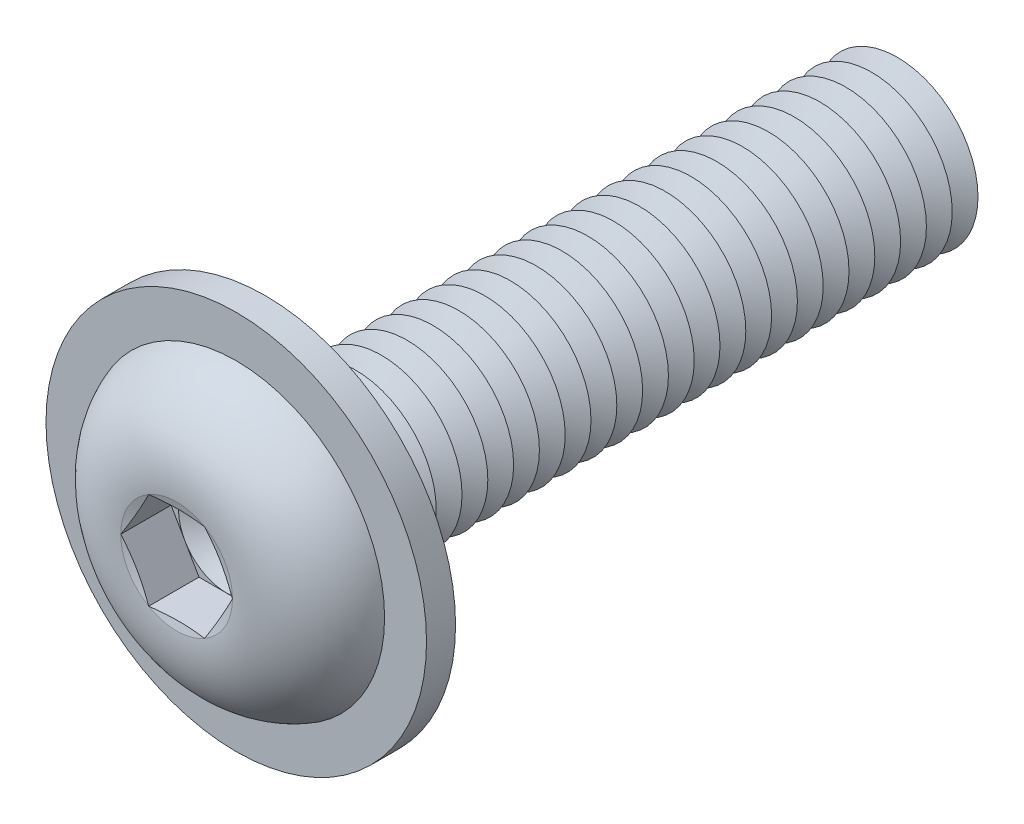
from build123d import *

# Parameters (mm, degrees)
FILLET1_R           = 0.4
LPATTERN1_COUNT     = 25
LPATTERN1_PITCH     = 0.8
CUT_EXTRUDE1_DEPTH  = 1.56
SKETCH5_R           = 5.9
SKETCH5_R_2         = 2.9
BOSS_EXTRUDE1_DEPTH = 0.9


with BuildPart() as part:
    # Sketch1 → Revolve1 (revolve)
    with BuildSketch(Plane(origin=(0, 0, 0), x_dir=(0, 0, -1), z_dir=(1, 0, 0)), mode=Mode.PRIVATE) as revolve1_sk:
        with BuildLine():
            Line((0, 2.5), (0, 4.75))
            ThreePointArc((0, 4.75), (-2.041477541, 3.848329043), (-2.75, 1.73205))
            Line((-2.75, 1.73205), (-2.517949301, 0.866025))
            Line((-2.517949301, 0.866025), (-2.75, 0.866025))
            Line((-2.75, 0.866025), (-2.75, 0))
            Line((-2.75, 0), (20, 0))
            Line((20, 0), (20, 2.5))
            Line((20, 2.5), (0, 2.5))
        make_face()
    revolve(revolve1_sk.sketch.rotate(Axis((0, 0, -20), (0, 0, 1)), 90), axis=Axis((0, 0, -20), (0, 0, 1)))

    # Fillet1
    fillet1_edges = [part.edges().sort_by_distance(p)[0] for p in [
        (2.5, 0, 0),
    ]]
    fillet(fillet1_edges, radius=FILLET1_R)

    # Sketch2 → Cut-Revolve1 (revolve, cut)
    with BuildSketch(Plane(origin=(0, 0, 0), x_dir=(0, 0, -1), z_dir=(1, 0, 0)), mode=Mode.PRIVATE) as cut_revolve1_sk:
        Polygon((19.6, 2.5), (20.4, 2.5), (20, 1.807179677), align=None)
    cut_revolve1 = revolve(cut_revolve1_sk.sketch.rotate(Axis((0, 0, -20), (0, 0, -1)), 270), axis=Axis((0, 0, -20), (0, 0, -1)), mode=Mode.SUBTRACT)

    # LPattern1: Cut-Revolve1 ×25
    with Locations(*[(0, 0, i * LPATTERN1_PITCH) for i in range(1, LPATTERN1_COUNT)]):
        add(cut_revolve1, mode=Mode.SUBTRACT)

    # Sketch3 → Cut-Extrude1 (cut)
    with BuildSketch(Plane.XY.offset(2.75)):
        Polygon((0.866025, 1.499999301), (-0.866025, 1.499999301), (-1.73205, 0), (-0.866025, -1.499999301), (0.866025, -1.499999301), (1.73205, 0), align=None)
    extrude(amount=-CUT_EXTRUDE1_DEPTH, mode=Mode.SUBTRACT)

    # Cut-Extrude2 cone 1 section (on through the dimple's axis) → Cut-Extrude2 (revolve, cut)
    with BuildSketch(Plane(origin=(0, 0, 1.19), x_dir=(0, -1, 0), z_dir=(1, 0, 0))):
        Polygon((0, 0), (1.499999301, 0), (0, 0.866025), align=None)
    revolve(axis=Axis((0, 0, 1.19), (0, 0, -1)), mode=Mode.SUBTRACT)

    # Sketch5 → Boss-Extrude1 (add)
    with BuildSketch(Plane(origin=(0, 0, 0), x_dir=(-1, 0, 0), z_dir=(0, 0, -1))):
        with Locations(Location((0, 0, 0), (0, 0, 90))):
            Circle(SKETCH5_R)
        Circle(SKETCH5_R_2, mode=Mode.SUBTRACT)
    extrude(amount=-BOSS_EXTRUDE1_DEPTH)


solid = part.part
